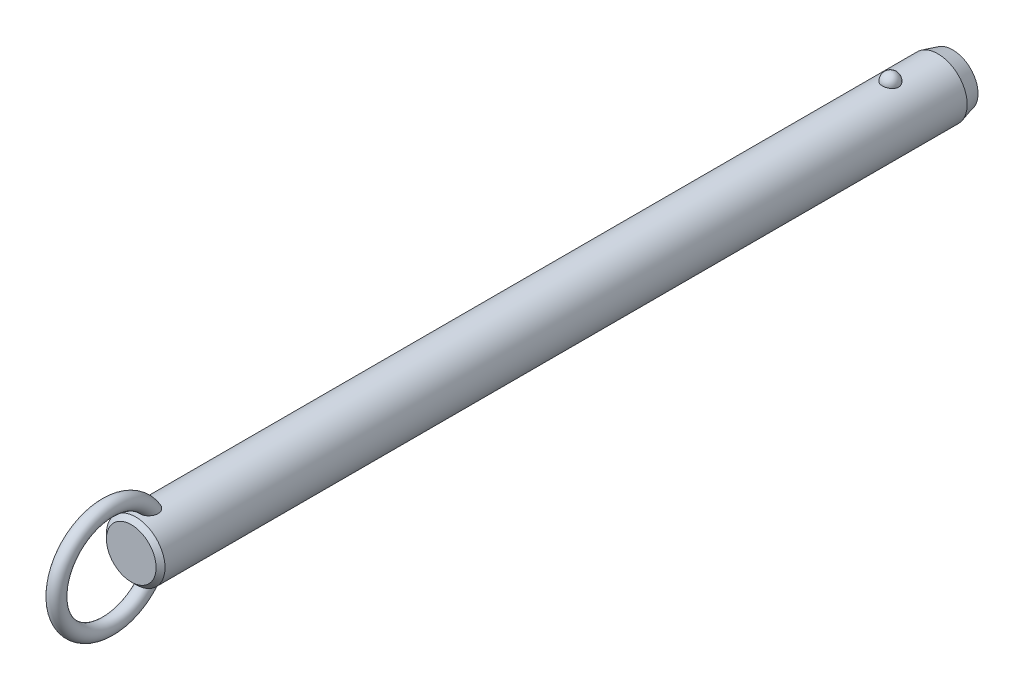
ISO-10303-21;
HEADER;
FILE_DESCRIPTION(('STEP AP214'),'2;1');
FILE_NAME('part.step','',(''),(''),'','','');
FILE_SCHEMA(('AUTOMOTIVE_DESIGN { 1 0 10303 214 1 1 1 1 }'));
ENDSEC;
DATA;
#1=APPLICATION_CONTEXT('core data for automotive mechanical design processes');
#2=APPLICATION_PROTOCOL_DEFINITION('international standard','automotive_design',2000,#1);
#3=PRODUCT_CONTEXT('',#1,'mechanical');
#4=PRODUCT('Part','Part','',(#3));
#5=PRODUCT_RELATED_PRODUCT_CATEGORY('part','',(#4));
#6=PRODUCT_DEFINITION_FORMATION('','',#4);
#7=PRODUCT_DEFINITION_CONTEXT('part definition',#1,'design');
#8=PRODUCT_DEFINITION('design','',#6,#7);
#9=PRODUCT_DEFINITION_SHAPE('','',#8);
#10=(LENGTH_UNIT() NAMED_UNIT(*) SI_UNIT(.MILLI.,.METRE.));
#11=(NAMED_UNIT(*) PLANE_ANGLE_UNIT() SI_UNIT($,.RADIAN.));
#12=(NAMED_UNIT(*) SI_UNIT($,.STERADIAN.) SOLID_ANGLE_UNIT());
#13=UNCERTAINTY_MEASURE_WITH_UNIT(LENGTH_MEASURE(1.E-05),#10,'distance_accuracy_value','');
#14=(GEOMETRIC_REPRESENTATION_CONTEXT(3) GLOBAL_UNCERTAINTY_ASSIGNED_CONTEXT((#13)) GLOBAL_UNIT_ASSIGNED_CONTEXT((#10,
#11,#12)) REPRESENTATION_CONTEXT('',''));
#15=CARTESIAN_POINT('',(0.,0.,0.));
#16=DIRECTION('',(0.,0.,1.));
#17=DIRECTION('',(1.,0.,0.));
#18=AXIS2_PLACEMENT_3D('',#15,#16,#17);
#19=CARTESIAN_POINT('',(0.,0.,193.));
#20=DIRECTION('',(0.,0.,-1.));
#21=DIRECTION('',(-1.,0.,0.));
#22=AXIS2_PLACEMENT_3D('',#19,#20,#21);
#23=CYLINDRICAL_SURFACE('',#22,7.9);
#24=CARTESIAN_POINT('',(2.1785689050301,7.59367088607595,-2.20000000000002));
#25=CARTESIAN_POINT('',(2.17856679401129,7.59367269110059,-2.07701843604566));
#26=CARTESIAN_POINT('',(2.16853481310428,7.59657145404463,-1.95401006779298));
#27=CARTESIAN_POINT('',(2.12864689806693,7.607843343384,-1.71147811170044));
#28=CARTESIAN_POINT('',(2.09878338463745,7.61621856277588,-1.5919558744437));
#29=CARTESIAN_POINT('',(2.0199931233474,7.63749180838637,-1.35985638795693));
#30=CARTESIAN_POINT('',(1.97107475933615,7.6503878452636,-1.24727610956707));
#31=CARTESIAN_POINT('',(1.85539377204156,7.67926115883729,-1.03213234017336));
#32=CARTESIAN_POINT('',(1.78863158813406,7.69523835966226,-0.929568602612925));
#33=CARTESIAN_POINT('',(1.63856494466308,7.7285848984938,-0.73678633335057));
#34=CARTESIAN_POINT('',(1.55518140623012,7.7459606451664,-0.646630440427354));
#35=CARTESIAN_POINT('',(1.37422937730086,7.78009978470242,-0.481747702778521));
#36=CARTESIAN_POINT('',(1.27666086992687,7.79686317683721,-0.407020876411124));
#37=CARTESIAN_POINT('',(1.07024728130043,7.82786153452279,-0.275278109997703));
#38=CARTESIAN_POINT('',(0.961434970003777,7.84210353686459,-0.218212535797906));
#39=CARTESIAN_POINT('',(0.735351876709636,7.86652194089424,-0.123146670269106));
#40=CARTESIAN_POINT('',(0.618082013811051,7.87669878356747,-0.0851443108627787));
#41=CARTESIAN_POINT('',(0.380637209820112,7.89170521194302,-0.0298158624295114));
#42=CARTESIAN_POINT('',(0.260550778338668,7.89662650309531,-0.0121347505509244));
#43=CARTESIAN_POINT('',(0.0190117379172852,7.90090003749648,0.00324379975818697));
#44=CARTESIAN_POINT('',(-0.102440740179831,7.90025280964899,0.000943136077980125));
#45=CARTESIAN_POINT('',(-0.341452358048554,7.89351056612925,-0.0233955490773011));
#46=CARTESIAN_POINT('',(-0.459042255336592,7.88749257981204,-0.0451545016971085));
#47=CARTESIAN_POINT('',(-0.688796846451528,7.87075812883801,-0.107408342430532));
#48=CARTESIAN_POINT('',(-0.800961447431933,7.86004158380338,-0.14790355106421));
#49=CARTESIAN_POINT('',(-1.01743634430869,7.83497131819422,-0.246799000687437));
#50=CARTESIAN_POINT('',(-1.12169791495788,7.82059709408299,-0.305300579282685));
#51=CARTESIAN_POINT('',(-1.31891765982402,7.78976470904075,-0.43854939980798));
#52=CARTESIAN_POINT('',(-1.41187469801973,7.77330633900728,-0.513298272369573));
#53=CARTESIAN_POINT('',(-1.58577142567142,7.73972434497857,-0.678622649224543));
#54=CARTESIAN_POINT('',(-1.66645140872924,7.72259402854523,-0.769470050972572));
#55=CARTESIAN_POINT('',(-1.81161503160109,7.68983776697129,-0.963538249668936));
#56=CARTESIAN_POINT('',(-1.87609753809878,7.6742119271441,-1.0667599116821));
#57=CARTESIAN_POINT('',(-1.98790138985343,7.6460202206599,-1.28401170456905));
#58=CARTESIAN_POINT('',(-2.03501994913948,7.63349104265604,-1.39815107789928));
#59=CARTESIAN_POINT('',(-2.10986724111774,7.6131449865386,-1.6330178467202));
#60=CARTESIAN_POINT('',(-2.1375965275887,7.60532797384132,-1.75374505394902));
#61=CARTESIAN_POINT('',(-2.17289256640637,7.5953195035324,-1.99782562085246));
#62=CARTESIAN_POINT('',(-2.18054294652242,7.59310471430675,-2.12116592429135));
#63=CARTESIAN_POINT('',(-2.17572919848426,7.59448538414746,-2.36741799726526));
#64=CARTESIAN_POINT('',(-2.1632656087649,7.59808068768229,-2.49032977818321));
#65=CARTESIAN_POINT('',(-2.11865035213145,7.61064035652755,-2.73161015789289));
#66=CARTESIAN_POINT('',(-2.08659579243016,7.61957823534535,-2.84999812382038));
#67=CARTESIAN_POINT('',(-2.00367799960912,7.64179982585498,-3.07955956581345));
#68=CARTESIAN_POINT('',(-1.9528140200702,7.65508371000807,-3.19073275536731));
#69=CARTESIAN_POINT('',(-1.83321113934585,7.68460381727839,-3.40337899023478));
#70=CARTESIAN_POINT('',(-1.76437735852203,7.70085556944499,-3.5047965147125));
#71=CARTESIAN_POINT('',(-1.61069526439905,7.73445734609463,-3.69446912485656));
#72=CARTESIAN_POINT('',(-1.52584634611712,7.75180741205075,-3.78272371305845));
#73=CARTESIAN_POINT('',(-1.34198059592,7.78574608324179,-3.94393987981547));
#74=CARTESIAN_POINT('',(-1.24291308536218,7.80233167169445,-4.01684434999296));
#75=CARTESIAN_POINT('',(-1.03352039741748,7.83281625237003,-4.14489386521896));
#76=CARTESIAN_POINT('',(-0.92319600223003,7.84671543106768,-4.20004014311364));
#77=CARTESIAN_POINT('',(-0.695822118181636,7.87011575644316,-4.29042017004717));
#78=CARTESIAN_POINT('',(-0.578872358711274,7.87966903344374,-4.32589112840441));
#79=CARTESIAN_POINT('',(-0.340410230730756,7.8935652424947,-4.37692226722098));
#80=CARTESIAN_POINT('',(-0.218898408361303,7.89790879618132,-4.39248482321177));
#81=CARTESIAN_POINT('',(0.0228107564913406,7.90087453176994,-4.40314405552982));
#82=CARTESIAN_POINT('',(0.142990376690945,7.89960185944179,-4.39861683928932));
#83=CARTESIAN_POINT('',(0.380829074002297,7.89171262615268,-4.37008293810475));
#84=CARTESIAN_POINT('',(0.498488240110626,7.8850962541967,-4.34607694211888));
#85=CARTESIAN_POINT('',(0.727535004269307,7.86726442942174,-4.27939317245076));
#86=CARTESIAN_POINT('',(0.838944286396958,7.85606616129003,-4.23678512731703));
#87=CARTESIAN_POINT('',(1.05295421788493,7.83025654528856,-4.13408348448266));
#88=CARTESIAN_POINT('',(1.15555431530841,7.81564498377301,-4.07398879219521));
#89=CARTESIAN_POINT('',(1.35076763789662,7.7843022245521,-3.93687432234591));
#90=CARTESIAN_POINT('',(1.4432046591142,7.76754209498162,-3.85961036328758));
#91=CARTESIAN_POINT('',(1.6139111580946,7.73387857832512,-3.69076949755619));
#92=CARTESIAN_POINT('',(1.6921781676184,7.71697516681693,-3.59919010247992));
#93=CARTESIAN_POINT('',(1.83380875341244,7.6845643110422,-3.40247278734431));
#94=CARTESIAN_POINT('',(1.89689280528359,7.66908588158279,-3.29712873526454));
#95=CARTESIAN_POINT('',(2.0047823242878,7.64159441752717,-3.07707931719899));
#96=CARTESIAN_POINT('',(2.0495945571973,7.62958010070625,-2.96237743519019));
#97=CARTESIAN_POINT('',(2.11580183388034,7.61146617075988,-2.74040519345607));
#98=CARTESIAN_POINT('',(2.13929812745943,7.60484503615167,-2.63379846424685));
#99=CARTESIAN_POINT('',(2.17068242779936,7.59594664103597,-2.4181348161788));
#100=CARTESIAN_POINT('',(2.17857077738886,7.59366928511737,-2.30907795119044));
#101=CARTESIAN_POINT('',(2.1785689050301,7.59367088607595,-2.20000000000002));
#102=B_SPLINE_CURVE_WITH_KNOTS('',3,(#24,#25,#26,#27,#28,#29,#30,#31,#32,#33,#34,#35,#36,#37,
#38,#39,#40,#41,#42,#43,#44,#45,#46,#47,#48,#49,#50,#51,#52,#53,#54,#55,#56,#57,#58,#59,#60,#61,
#62,#63,#64,#65,#66,#67,#68,#69,#70,#71,#72,#73,#74,#75,#76,#77,#78,#79,#80,#81,#82,#83,#84,#85,
#86,#87,#88,#89,#90,#91,#92,#93,#94,#95,#96,#97,#98,#99,#100,#101),.UNSPECIFIED.,.T.,.F.,(4,2,2,
2,2,2,2,2,2,2,2,2,2,2,2,2,2,2,2,2,2,2,2,2,2,2,2,2,2,2,2,2,2,2,2,2,2,2,4),(0.,0.368552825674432,
0.737246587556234,1.10577831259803,1.4743009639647,1.8446206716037,2.21494081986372,
2.5842105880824,2.95344028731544,3.31611630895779,3.67875788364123,4.03628044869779,
4.39380913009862,4.75338791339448,5.11300280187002,5.47939989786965,5.8458226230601,
6.21639834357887,6.58696347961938,6.95598276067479,7.32499216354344,7.69218715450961,
8.0593967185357,8.42858578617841,8.79778880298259,9.16834203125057,9.5388695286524,
9.90482699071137,10.2707407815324,10.6298333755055,10.9889132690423,11.3466585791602,
11.7044262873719,12.0676511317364,12.4309391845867,12.8004764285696,13.1698767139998,
13.4967701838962,13.8236564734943),.UNSPECIFIED.);
#103=CARTESIAN_POINT('',(2.1785689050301,7.59367088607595,-2.20000000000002));
#104=VERTEX_POINT('',#103);
#105=EDGE_CURVE('E41',#104,#104,#102,.T.);
#106=ORIENTED_EDGE('',*,*,#105,.T.);
#107=EDGE_LOOP('',(#106));
#108=FACE_BOUND('',#107,.T.);
#109=CARTESIAN_POINT('',(0.,0.,201.32));
#110=DIRECTION('',(0.,0.,1.));
#111=DIRECTION('',(1.,0.,0.));
#112=AXIS2_PLACEMENT_3D('',#109,#110,#111);
#113=CIRCLE('',#112,7.9);
#114=CARTESIAN_POINT('',(7.9,0.,201.32));
#115=VERTEX_POINT('',#114);
#116=EDGE_CURVE('E10',#115,#115,#113,.F.);
#117=ORIENTED_EDGE('',*,*,#116,.T.);
#118=EDGE_LOOP('',(#117));
#119=FACE_BOUND('',#118,.T.);
#120=CARTESIAN_POINT('',(-0.630969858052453,-7.87476203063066,195.212432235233));
#121=CARTESIAN_POINT('',(-0.734180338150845,-7.86648998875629,195.247285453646));
#122=CARTESIAN_POINT('',(-0.83447695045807,-7.85639291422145,195.290816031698));
#123=CARTESIAN_POINT('',(-1.0262035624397,-7.83366343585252,195.394094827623));
#124=CARTESIAN_POINT('',(-1.1176141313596,-7.82102565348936,195.453877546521));
#125=CARTESIAN_POINT('',(-1.28877277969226,-7.79464922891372,195.587839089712));
#126=CARTESIAN_POINT('',(-1.36854014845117,-7.78091246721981,195.661993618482));
#127=CARTESIAN_POINT('',(-1.51461521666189,-7.75380398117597,195.822494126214));
#128=CARTESIAN_POINT('',(-1.58092966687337,-7.74043207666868,195.908833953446));
#129=CARTESIAN_POINT('',(-1.70019064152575,-7.7151252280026,196.092978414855));
#130=CARTESIAN_POINT('',(-1.75284037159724,-7.70322473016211,196.190979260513));
#131=CARTESIAN_POINT('',(-1.84263464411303,-7.68224112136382,196.394102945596));
#132=CARTESIAN_POINT('',(-1.87977299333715,-7.6731591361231,196.499228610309));
#133=CARTESIAN_POINT('',(-1.94152728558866,-7.65777930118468,196.723284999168));
#134=CARTESIAN_POINT('',(-1.96475471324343,-7.65179654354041,196.842616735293));
#135=CARTESIAN_POINT('',(-1.99449499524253,-7.64409642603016,197.08342986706));
#136=CARTESIAN_POINT('',(-2.0010005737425,-7.64238092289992,197.204912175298));
#137=CARTESIAN_POINT('',(-1.99856014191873,-7.64302120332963,197.468340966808));
#138=CARTESIAN_POINT('',(-1.98680021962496,-7.64611845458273,197.61025654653));
#139=CARTESIAN_POINT('',(-1.94457772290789,-7.65696186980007,197.891118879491));
#140=CARTESIAN_POINT('',(-1.91409393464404,-7.66471330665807,198.030062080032));
#141=CARTESIAN_POINT('',(-1.82768670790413,-7.68582947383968,198.331939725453));
#142=CARTESIAN_POINT('',(-1.76772963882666,-7.70003779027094,198.493686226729));
#143=CARTESIAN_POINT('',(-1.65998501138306,-7.72371550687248,198.727695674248));
#144=CARTESIAN_POINT('',(-1.62107967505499,-7.73200670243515,198.804297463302));
#145=CARTESIAN_POINT('',(-1.53727726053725,-7.7491037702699,198.954079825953));
#146=CARTESIAN_POINT('',(-1.49238215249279,-7.75790947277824,199.027261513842));
#147=CARTESIAN_POINT('',(-1.37397050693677,-7.77993338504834,199.20288382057));
#148=CARTESIAN_POINT('',(-1.29690364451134,-7.79328473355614,199.302955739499));
#149=CARTESIAN_POINT('',(-1.12885487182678,-7.81939266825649,199.490714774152));
#150=CARTESIAN_POINT('',(-1.03789926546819,-7.83215032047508,199.578424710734));
#151=CARTESIAN_POINT('',(-0.869532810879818,-7.85231710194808,199.713414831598));
#152=CARTESIAN_POINT('',(-0.795716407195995,-7.86021093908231,199.765076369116));
#153=CARTESIAN_POINT('',(-0.640813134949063,-7.87434920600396,199.856381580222));
#154=CARTESIAN_POINT('',(-0.559737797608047,-7.88059619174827,199.89604389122));
#155=CARTESIAN_POINT('',(-0.406456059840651,-7.88984116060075,199.954300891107));
#156=CARTESIAN_POINT('',(-0.335227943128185,-7.89321892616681,199.975384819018));
#157=CARTESIAN_POINT('',(-0.190193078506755,-7.89804235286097,200.00541418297));
#158=CARTESIAN_POINT('',(-0.116388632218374,-7.89948969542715,200.014370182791));
#159=CARTESIAN_POINT('',(0.0318414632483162,-7.90028409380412,200.019291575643));
#160=CARTESIAN_POINT('',(0.106268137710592,-7.89962640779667,200.015227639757));
#161=CARTESIAN_POINT('',(0.253290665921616,-7.8962818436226,199.994461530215));
#162=CARTESIAN_POINT('',(0.325885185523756,-7.8935935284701,199.977750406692));
#163=CARTESIAN_POINT('',(0.481441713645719,-7.88577340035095,199.928738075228));
#164=CARTESIAN_POINT('',(0.563611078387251,-7.88026321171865,199.894005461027));
#165=CARTESIAN_POINT('',(0.721129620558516,-7.86741729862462,199.811796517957));
#166=CARTESIAN_POINT('',(0.79646633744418,-7.86007832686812,199.764297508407));
#167=CARTESIAN_POINT('',(0.971456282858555,-7.84073285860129,199.636513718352));
#168=CARTESIAN_POINT('',(1.06719686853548,-7.82809461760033,199.551004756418));
#169=CARTESIAN_POINT('',(1.24418921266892,-7.80192439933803,199.366232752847));
#170=CARTESIAN_POINT('',(1.32540832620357,-7.78839049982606,199.266939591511));
#171=CARTESIAN_POINT('',(1.45199971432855,-7.76559693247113,199.089576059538));
#172=CARTESIAN_POINT('',(1.50085649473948,-7.75626094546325,199.013954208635));
#173=CARTESIAN_POINT('',(1.59197749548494,-7.73807279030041,198.858742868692));
#174=CARTESIAN_POINT('',(1.63423919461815,-7.72922080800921,198.779151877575));
#175=CARTESIAN_POINT('',(1.71222612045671,-7.71231959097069,198.616664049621));
#176=CARTESIAN_POINT('',(1.7479451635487,-7.70427111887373,198.533764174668));
#177=CARTESIAN_POINT('',(1.81270113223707,-7.68929240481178,198.365296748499));
#178=CARTESIAN_POINT('',(1.84173789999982,-7.68236218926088,198.279729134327));
#179=CARTESIAN_POINT('',(1.89322698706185,-7.6698375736,198.10528702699));
#180=CARTESIAN_POINT('',(1.91558744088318,-7.66426199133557,198.016383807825));
#181=CARTESIAN_POINT('',(1.95281367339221,-7.65485915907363,197.836969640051));
#182=CARTESIAN_POINT('',(1.96767946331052,-7.65103190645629,197.746458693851));
#183=CARTESIAN_POINT('',(2.0002145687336,-7.64262981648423,197.473732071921));
#184=CARTESIAN_POINT('',(2.00600691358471,-7.6410871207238,197.289709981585));
#185=CARTESIAN_POINT('',(1.98445334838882,-7.64669564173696,196.976501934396));
#186=CARTESIAN_POINT('',(1.96607186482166,-7.65149688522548,196.846618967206));
#187=CARTESIAN_POINT('',(1.90884967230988,-7.66597624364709,196.591632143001));
#188=CARTESIAN_POINT('',(1.87002101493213,-7.67565148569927,196.466525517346));
#189=CARTESIAN_POINT('',(1.77063986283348,-7.69918471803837,196.22454013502));
#190=CARTESIAN_POINT('',(1.70993724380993,-7.71307150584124,196.107725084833));
#191=CARTESIAN_POINT('',(1.56733070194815,-7.74330306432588,195.888144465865));
#192=CARTESIAN_POINT('',(1.48543692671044,-7.75964665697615,195.785372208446));
#193=CARTESIAN_POINT('',(1.31346177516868,-7.79047523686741,195.609380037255));
#194=CARTESIAN_POINT('',(1.22547278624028,-7.80495298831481,195.534106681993));
#195=CARTESIAN_POINT('',(1.03724352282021,-7.83218597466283,195.400486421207));
#196=CARTESIAN_POINT('',(0.937008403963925,-7.84494192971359,195.342132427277));
#197=CARTESIAN_POINT('',(0.733599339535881,-7.86649045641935,195.247027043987));
#198=CARTESIAN_POINT('',(0.630941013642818,-7.87547134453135,195.209210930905));
#199=CARTESIAN_POINT('',(0.420465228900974,-7.88950708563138,195.151116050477));
#200=CARTESIAN_POINT('',(0.31264590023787,-7.89456050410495,195.13084369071));
#201=CARTESIAN_POINT('',(0.096086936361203,-7.9001518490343,195.108455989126));
#202=CARTESIAN_POINT('',(-0.0126341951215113,-7.90073226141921,195.106169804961));
#203=CARTESIAN_POINT('',(-0.228766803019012,-7.89742350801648,195.119367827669));
#204=CARTESIAN_POINT('',(-0.336180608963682,-7.89354403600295,195.134813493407));
#205=CARTESIAN_POINT('',(-0.473410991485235,-7.88586871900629,195.166217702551));
#206=CARTESIAN_POINT('',(-0.50525779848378,-7.88388984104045,195.174354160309));
#207=CARTESIAN_POINT('',(-0.56848128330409,-7.87958326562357,195.192208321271));
#208=CARTESIAN_POINT('',(-0.59985795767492,-7.87725556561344,195.201926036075));
#209=CARTESIAN_POINT('',(-0.630969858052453,-7.87476203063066,195.212432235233));
#210=B_SPLINE_CURVE_WITH_KNOTS('',3,(#120,#121,#122,#123,#124,#125,#126,#127,#128,#129,#130,
#131,#132,#133,#134,#135,#136,#137,#138,#139,#140,#141,#142,#143,#144,#145,#146,#147,#148,#149,
#150,#151,#152,#153,#154,#155,#156,#157,#158,#159,#160,#161,#162,#163,#164,#165,#166,#167,#168,
#169,#170,#171,#172,#173,#174,#175,#176,#177,#178,#179,#180,#181,#182,#183,#184,#185,#186,#187,
#188,#189,#190,#191,#192,#193,#194,#195,#196,#197,#198,#199,#200,#201,#202,#203,#204,#205,#206,
#207,#208,#209),.UNSPECIFIED.,.T.,.F.,(4,2,2,2,2,2,2,2,2,2,2,2,2,2,2,2,2,2,2,2,2,2,2,2,2,2,2,2,
2,2,2,2,2,2,2,2,2,2,2,2,2,2,2,2,4),(0.,0.327622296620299,0.655945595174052,0.983718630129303,
1.3113267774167,1.64554655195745,1.97989964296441,2.34365728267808,2.70757317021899,
3.13333684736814,3.5595838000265,4.07655306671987,4.33527897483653,4.59391999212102,
4.97382437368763,5.353017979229,5.62348245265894,5.89352465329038,6.11565959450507,
6.33760092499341,6.56004255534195,6.78264174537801,7.04930844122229,7.31645206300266,
7.70130871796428,8.08701995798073,8.35824509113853,8.6295736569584,8.90115735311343,
9.1727474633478,9.44791855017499,9.72308922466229,10.2715298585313,10.6638393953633,
11.0559179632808,11.4507403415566,11.8453740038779,12.1936425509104,12.5417649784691,
12.8695063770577,13.1973674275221,13.5221104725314,13.8461490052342,13.9449071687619,
14.0436660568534),.UNSPECIFIED.);
#211=CARTESIAN_POINT('',(-0.630969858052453,-7.87476203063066,195.212432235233));
#212=VERTEX_POINT('',#211);
#213=EDGE_CURVE('E59',#212,#212,#210,.T.);
#214=ORIENTED_EDGE('',*,*,#213,.T.);
#215=EDGE_LOOP('',(#214));
#216=FACE_BOUND('',#215,.T.);
#217=CARTESIAN_POINT('',(-0.630969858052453,7.87476203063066,195.212432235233));
#218=CARTESIAN_POINT('',(-0.528918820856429,7.88293636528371,195.177979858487));
#219=CARTESIAN_POINT('',(-0.423745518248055,7.88934810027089,195.151915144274));
#220=CARTESIAN_POINT('',(-0.210236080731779,7.8979273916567,195.117282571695));
#221=CARTESIAN_POINT('',(-0.10189380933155,7.90008607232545,195.108751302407));
#222=CARTESIAN_POINT('',(0.114660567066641,7.89990877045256,195.109457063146));
#223=CARTESIAN_POINT('',(0.222872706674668,7.89757640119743,195.11867980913));
#224=CARTESIAN_POINT('',(0.436107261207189,7.88867538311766,195.154652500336));
#225=CARTESIAN_POINT('',(0.541131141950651,7.8821087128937,195.18139425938));
#226=CARTESIAN_POINT('',(0.745085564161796,7.86545130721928,195.251756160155));
#227=CARTESIAN_POINT('',(0.844015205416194,7.85536005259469,195.295378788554));
#228=CARTESIAN_POINT('',(1.03299167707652,7.83275153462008,195.398379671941));
#229=CARTESIAN_POINT('',(1.12303841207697,7.8202342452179,195.457758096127));
#230=CARTESIAN_POINT('',(1.29214734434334,7.79408219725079,195.590864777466));
#231=CARTESIAN_POINT('',(1.37116907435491,7.78044359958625,195.664643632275));
#232=CARTESIAN_POINT('',(1.51597677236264,7.75353170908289,195.824235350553));
#233=CARTESIAN_POINT('',(1.58176261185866,7.74025841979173,195.910048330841));
#234=CARTESIAN_POINT('',(1.70057386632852,7.71504069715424,196.093644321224));
#235=CARTESIAN_POINT('',(1.75320073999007,7.7031425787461,196.191690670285));
#236=CARTESIAN_POINT('',(1.8429376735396,7.68216822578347,196.394893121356));
#237=CARTESIAN_POINT('',(1.88004278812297,7.67309289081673,196.500051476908));
#238=CARTESIAN_POINT('',(1.9417232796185,7.6577294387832,196.724167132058));
#239=CARTESIAN_POINT('',(1.96491037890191,7.65175648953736,196.843524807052));
#240=CARTESIAN_POINT('',(1.9945689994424,7.64407702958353,197.084384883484));
#241=CARTESIAN_POINT('',(2.00103304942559,7.64237242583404,197.20588821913));
#242=CARTESIAN_POINT('',(1.99850166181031,7.64303650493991,197.469368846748));
#243=CARTESIAN_POINT('',(1.98669038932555,7.64614714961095,197.611314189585));
#244=CARTESIAN_POINT('',(1.94436120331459,7.6570170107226,197.892228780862));
#245=CARTESIAN_POINT('',(1.91382203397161,7.66478150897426,198.031194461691));
#246=CARTESIAN_POINT('',(1.82728754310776,7.68592483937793,198.333111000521));
#247=CARTESIAN_POINT('',(1.76725778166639,7.7001468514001,198.494872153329));
#248=CARTESIAN_POINT('',(1.65939700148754,7.72384204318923,198.728891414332));
#249=CARTESIAN_POINT('',(1.62045187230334,7.73213852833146,198.805494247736));
#250=CARTESIAN_POINT('',(1.53656684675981,7.74924489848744,198.955273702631));
#251=CARTESIAN_POINT('',(1.49162892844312,7.75805461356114,199.028451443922));
#252=CARTESIAN_POINT('',(1.37317698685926,7.78007342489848,199.203952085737));
#253=CARTESIAN_POINT('',(1.29612360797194,7.79341423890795,199.303911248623));
#254=CARTESIAN_POINT('',(1.12812043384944,7.81949839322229,199.49145083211));
#255=CARTESIAN_POINT('',(1.03719688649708,7.83224280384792,199.579054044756));
#256=CARTESIAN_POINT('',(0.868871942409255,7.85239026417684,199.71389715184));
#257=CARTESIAN_POINT('',(0.795056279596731,7.86027769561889,199.765511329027));
#258=CARTESIAN_POINT('',(0.640160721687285,7.87440222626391,199.856720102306));
#259=CARTESIAN_POINT('',(0.559092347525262,7.88064188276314,199.896333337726));
#260=CARTESIAN_POINT('',(0.405820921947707,7.8898738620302,199.954505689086));
#261=CARTESIAN_POINT('',(0.334594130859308,7.89324577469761,199.975552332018));
#262=CARTESIAN_POINT('',(0.189568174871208,7.89805733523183,200.005507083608));
#263=CARTESIAN_POINT('',(0.115771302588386,7.89949866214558,200.014425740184));
#264=CARTESIAN_POINT('',(-0.0324359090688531,7.90028156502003,200.01927589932));
#265=CARTESIAN_POINT('',(-0.106847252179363,7.89961843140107,200.015178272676));
#266=CARTESIAN_POINT('',(-0.253834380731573,7.8962642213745,199.994351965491));
#267=CARTESIAN_POINT('',(-0.326408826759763,7.89357170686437,199.977614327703));
#268=CARTESIAN_POINT('',(-0.481962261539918,7.88574179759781,199.928539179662));
#269=CARTESIAN_POINT('',(-0.564145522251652,7.88022507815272,199.893763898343));
#270=CARTESIAN_POINT('',(-0.721685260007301,7.86736646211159,199.811468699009));
#271=CARTESIAN_POINT('',(-0.797029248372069,7.8600213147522,199.763926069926));
#272=CARTESIAN_POINT('',(-0.972044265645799,7.84066026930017,199.636026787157));
#273=CARTESIAN_POINT('',(-1.06779803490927,7.82801274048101,199.550443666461));
#274=CARTESIAN_POINT('',(-1.2448053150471,7.80182621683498,199.365522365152));
#275=CARTESIAN_POINT('',(-1.32602618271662,7.78828530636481,199.266154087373));
#276=CARTESIAN_POINT('',(-1.45259834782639,7.76548487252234,199.088680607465));
#277=CARTESIAN_POINT('',(-1.50143856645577,7.75614818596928,199.013025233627));
#278=CARTESIAN_POINT('',(-1.59252410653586,7.73796020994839,198.857748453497));
#279=CARTESIAN_POINT('',(-1.63476690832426,7.72910910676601,198.778125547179));
#280=CARTESIAN_POINT('',(-1.71271318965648,7.71221133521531,198.615575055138));
#281=CARTESIAN_POINT('',(-1.74841047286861,7.70416543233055,198.532644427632));
#282=CARTESIAN_POINT('',(-1.81311929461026,7.6891937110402,198.364116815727));
#283=CARTESIAN_POINT('',(-1.84213067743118,7.68226791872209,198.278519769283));
#284=CARTESIAN_POINT('',(-1.89356259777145,7.66975461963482,198.104025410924));
#285=CARTESIAN_POINT('',(-1.91589165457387,7.66418586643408,198.015099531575));
#286=CARTESIAN_POINT('',(-1.9530507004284,7.65479859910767,197.835642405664));
#287=CARTESIAN_POINT('',(-1.96788069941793,7.65098008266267,197.745111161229));
#288=CARTESIAN_POINT('',(-2.00030078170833,7.64260704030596,197.472327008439));
#289=CARTESIAN_POINT('',(-2.00600576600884,7.64108760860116,197.288271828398));
#290=CARTESIAN_POINT('',(-1.9842848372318,7.64673945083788,196.975080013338));
#291=CARTESIAN_POINT('',(-1.96583698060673,7.65155751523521,196.845240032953));
#292=CARTESIAN_POINT('',(-1.90848948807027,7.66606613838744,196.590361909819));
#293=CARTESIAN_POINT('',(-1.86960376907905,7.67575338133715,196.465320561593));
#294=CARTESIAN_POINT('',(-1.77013421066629,7.6993013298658,196.223500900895));
#295=CARTESIAN_POINT('',(-1.70940488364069,7.71318991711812,196.106784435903));
#296=CARTESIAN_POINT('',(-1.56672953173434,7.74342495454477,195.887340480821));
#297=CARTESIAN_POINT('',(-1.48478316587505,7.75977144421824,195.78461321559));
#298=CARTESIAN_POINT('',(-1.31266325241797,7.79061163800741,195.608643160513));
#299=CARTESIAN_POINT('',(-1.22456383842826,7.80509908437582,195.533358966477));
#300=CARTESIAN_POINT('',(-1.03622400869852,7.83231881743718,195.399865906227));
#301=CARTESIAN_POINT('',(-0.936015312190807,7.84505551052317,195.341613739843));
#302=CARTESIAN_POINT('',(-0.798824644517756,7.85957802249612,195.277540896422));
#303=CARTESIAN_POINT('',(-0.765787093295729,7.86286821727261,195.263224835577));
#304=CARTESIAN_POINT('',(-0.698939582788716,7.86909211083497,195.236436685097));
#305=CARTESIAN_POINT('',(-0.66512963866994,7.8720258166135,195.223964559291));
#306=CARTESIAN_POINT('',(-0.630969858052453,7.87476203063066,195.212432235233));
#307=B_SPLINE_CURVE_WITH_KNOTS('',3,(#217,#218,#219,#220,#221,#222,#223,#224,#225,#226,#227,
#228,#229,#230,#231,#232,#233,#234,#235,#236,#237,#238,#239,#240,#241,#242,#243,#244,#245,#246,
#247,#248,#249,#250,#251,#252,#253,#254,#255,#256,#257,#258,#259,#260,#261,#262,#263,#264,#265,
#266,#267,#268,#269,#270,#271,#272,#273,#274,#275,#276,#277,#278,#279,#280,#281,#282,#283,#284,
#285,#286,#287,#288,#289,#290,#291,#292,#293,#294,#295,#296,#297,#298,#299,#300,#301,#302,#303,
#304,#305,#306),.UNSPECIFIED.,.T.,.F.,(4,2,2,2,2,2,2,2,2,2,2,2,2,2,2,2,2,2,2,2,2,2,2,2,2,2,2,2,
2,2,2,2,2,2,2,2,2,2,2,2,2,2,2,2,4),(0.,0.323920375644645,0.648516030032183,0.972850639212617,
1.29703380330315,1.62126473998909,1.94549915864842,2.27089401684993,2.5962920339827,
2.93059633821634,3.26500707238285,3.6288164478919,3.99278833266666,4.41865421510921,
4.84500434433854,5.36209210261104,5.62087589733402,5.87957448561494,6.25918598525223,
6.63808782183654,6.90846748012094,7.17842501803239,7.40052350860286,7.6224287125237,
7.84483086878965,8.06739077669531,8.33414615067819,8.60137921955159,8.98641454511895,
9.37230415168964,9.64358673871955,9.91497268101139,10.1866142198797,10.4582620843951,
10.7334745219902,11.008686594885,11.5572126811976,11.9494246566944,12.3413699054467,
12.7359755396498,13.1305875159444,13.4791770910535,13.82687259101,13.9353013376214,
14.0437279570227),.UNSPECIFIED.);
#308=CARTESIAN_POINT('',(-0.630969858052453,7.87476203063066,195.212432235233));
#309=VERTEX_POINT('',#308);
#310=EDGE_CURVE('E67',#309,#309,#307,.T.);
#311=ORIENTED_EDGE('',*,*,#310,.T.);
#312=EDGE_LOOP('',(#311));
#313=FACE_BOUND('',#312,.T.);
#314=CARTESIAN_POINT('',(0.,0.,-15.));
#315=DIRECTION('',(0.,0.,-1.));
#316=DIRECTION('',(-1.,0.,0.));
#317=AXIS2_PLACEMENT_3D('',#314,#315,#316);
#318=CIRCLE('',#317,7.9);
#319=CARTESIAN_POINT('',(-7.9,0.,-15.));
#320=VERTEX_POINT('',#319);
#321=EDGE_CURVE('E56',#320,#320,#318,.F.);
#322=ORIENTED_EDGE('',*,*,#321,.T.);
#323=EDGE_LOOP('',(#322));
#324=FACE_BOUND('',#323,.T.);
#325=ADVANCED_FACE('F37',(#108,#119,#216,#313,#324),#23,.T.);
#326=CARTESIAN_POINT('',(0.,0.,-19.));
#327=DIRECTION('',(0.,0.,-1.));
#328=DIRECTION('',(-1.,0.,0.));
#329=AXIS2_PLACEMENT_3D('',#326,#327,#328);
#330=PLANE('',#329);
#331=CARTESIAN_POINT('',(0.,0.,-19.));
#332=DIRECTION('',(0.,0.,-1.));
#333=DIRECTION('',(-1.,0.,0.));
#334=AXIS2_PLACEMENT_3D('',#331,#332,#333);
#335=CIRCLE('',#334,6.82820323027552);
#336=CARTESIAN_POINT('',(-6.82820323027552,0.,-19.));
#337=VERTEX_POINT('',#336);
#338=EDGE_CURVE('E66',#337,#337,#335,.T.);
#339=ORIENTED_EDGE('',*,*,#338,.T.);
#340=EDGE_LOOP('',(#339));
#341=FACE_BOUND('',#340,.T.);
#342=ADVANCED_FACE('F85',(#341),#330,.T.);
#343=CARTESIAN_POINT('',(0.,0.,-19.));
#344=DIRECTION('',(0.,0.,1.));
#345=DIRECTION('',(1.,0.,0.));
#346=AXIS2_PLACEMENT_3D('',#343,#344,#345);
#347=CONICAL_SURFACE('',#346,6.82820323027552,0.261799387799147);
#348=ORIENTED_EDGE('',*,*,#321,.F.);
#349=EDGE_LOOP('',(#348));
#350=FACE_BOUND('',#349,.T.);
#351=ORIENTED_EDGE('',*,*,#338,.F.);
#352=EDGE_LOOP('',(#351));
#353=FACE_BOUND('',#352,.T.);
#354=ADVANCED_FACE('F83',(#350,#353),#347,.T.);
#355=CARTESIAN_POINT('',(0.,0.,202.52));
#356=DIRECTION('',(0.,0.,1.));
#357=DIRECTION('',(1.,0.,0.));
#358=AXIS2_PLACEMENT_3D('',#355,#356,#357);
#359=PLANE('',#358);
#360=CARTESIAN_POINT('',(0.,0.,202.52));
#361=DIRECTION('',(0.,0.,1.));
#362=DIRECTION('',(1.,0.,0.));
#363=AXIS2_PLACEMENT_3D('',#360,#361,#362);
#364=CIRCLE('',#363,6.70000000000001);
#365=CARTESIAN_POINT('',(6.70000000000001,0.,202.52));
#366=VERTEX_POINT('',#365);
#367=EDGE_CURVE('E50',#366,#366,#364,.T.);
#368=ORIENTED_EDGE('',*,*,#367,.T.);
#369=EDGE_LOOP('',(#368));
#370=FACE_BOUND('',#369,.T.);
#371=ADVANCED_FACE('F77',(#370),#359,.T.);
#372=CARTESIAN_POINT('',(0.,0.,208.85));
#373=DIRECTION('',(1.,0.,0.));
#374=DIRECTION('',(0.,0.,-1.));
#375=AXIS2_PLACEMENT_3D('',#372,#373,#374);
#376=TOROIDAL_SURFACE('',#375,13.85,2.);
#377=ORIENTED_EDGE('',*,*,#310,.F.);
#378=EDGE_LOOP('',(#377));
#379=FACE_BOUND('',#378,.T.);
#380=ORIENTED_EDGE('',*,*,#213,.F.);
#381=EDGE_LOOP('',(#380));
#382=FACE_BOUND('',#381,.T.);
#383=ADVANCED_FACE('F73',(#379,#382),#376,.T.);
#384=CARTESIAN_POINT('',(0.,0.,202.52));
#385=DIRECTION('',(0.,0.,-1.));
#386=DIRECTION('',(-1.,0.,0.));
#387=AXIS2_PLACEMENT_3D('',#384,#385,#386);
#388=CONICAL_SURFACE('',#387,6.70000000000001,0.785398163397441);
#389=ORIENTED_EDGE('',*,*,#116,.F.);
#390=EDGE_LOOP('',(#389));
#391=FACE_BOUND('',#390,.T.);
#392=ORIENTED_EDGE('',*,*,#367,.F.);
#393=EDGE_LOOP('',(#392));
#394=FACE_BOUND('',#393,.T.);
#395=ADVANCED_FACE('F39',(#391,#394),#388,.T.);
#396=CARTESIAN_POINT('',(0.,7.9,-2.20000000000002));
#397=DIRECTION('',(0.,1.,0.));
#398=DIRECTION('',(0.,0.,-1.));
#399=AXIS2_PLACEMENT_3D('',#396,#397,#398);
#400=SPHERICAL_SURFACE('',#399,2.2);
#401=ORIENTED_EDGE('',*,*,#105,.F.);
#402=EDGE_LOOP('',(#401));
#403=FACE_BOUND('',#402,.T.);
#404=ADVANCED_FACE('F79',(#403),#400,.T.);
#405=CLOSED_SHELL('',(#325,#342,#354,#371,#383,#395,#404));
#406=MANIFOLD_SOLID_BREP('B2',#405);
#407=ADVANCED_BREP_SHAPE_REPRESENTATION('',(#18,#406),#14);
#408=SHAPE_DEFINITION_REPRESENTATION(#9,#407);
ENDSEC;
END-ISO-10303-21;
